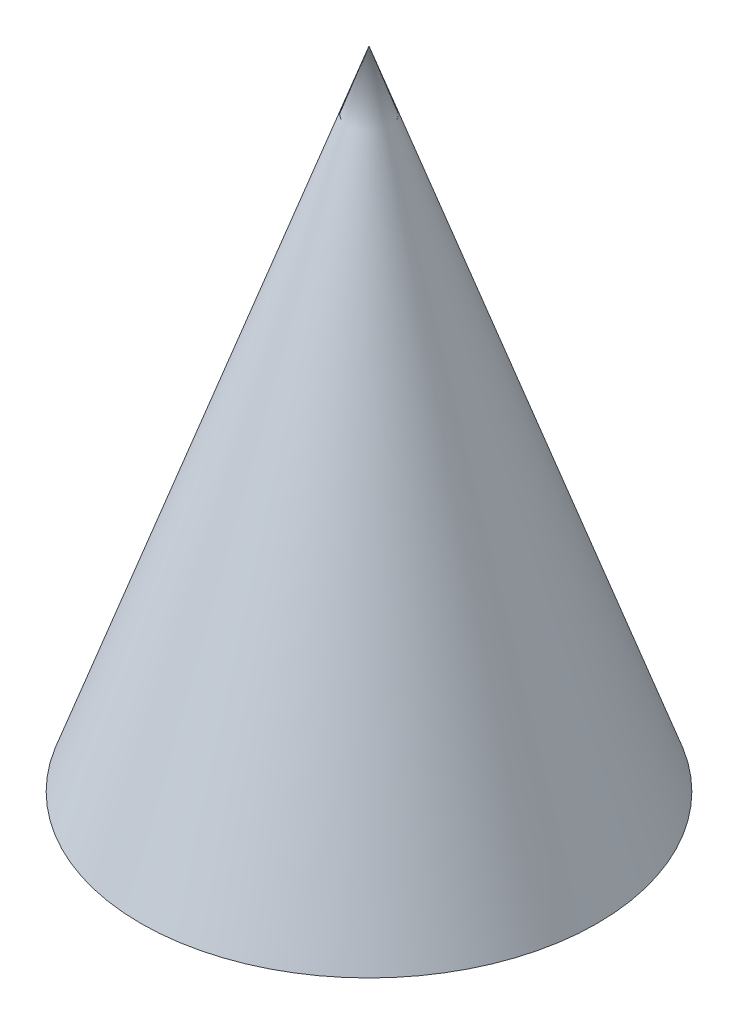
from build123d import *


with BuildPart() as part:
    # Sketch 1 → Revolve 1 (revolve)
    with BuildSketch(Plane.XY, mode=Mode.PRIVATE) as revolve_1_sk:
        Polygon((0, 53.909610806), (-20, -2.658931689), (0, -2.658931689), align=None)
    revolve(revolve_1_sk.sketch.rotate(Axis((0, 67.982352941, 0), (0, -1, 0)), 90), axis=Axis((0, 67.982352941, 0), (0, -1, 0)))


solid = part.part
